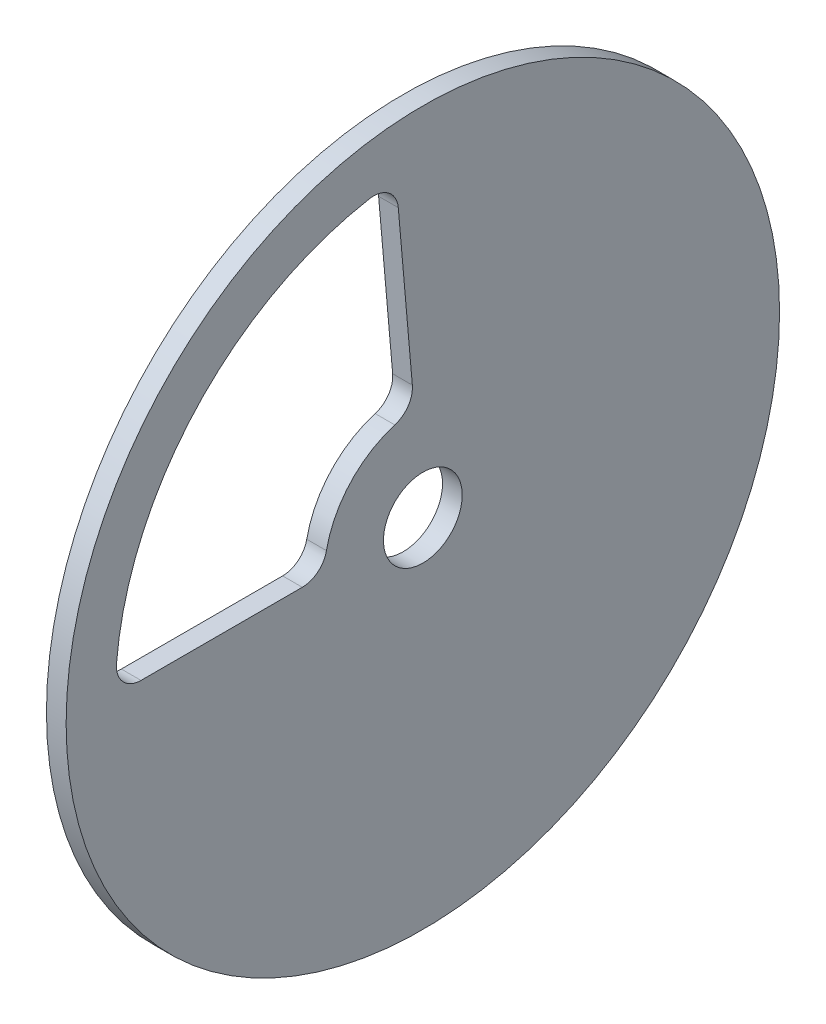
from build123d import *

# Parameters (mm, degrees)
SKETCH1_R           = 14.5
SKETCH1_R_2         = 1.6
BOSS_EXTRUDE1_DEPTH = 0.8


with BuildPart() as part:
    # Sketch1 → Boss-Extrude1 (new body)
    with BuildSketch(Plane(origin=(0, 0, 0), x_dir=(0, 0, -1), z_dir=(1, 0, 0))):
        Circle(SKETCH1_R)
        Circle(SKETCH1_R_2, mode=Mode.SUBTRACT)
        with BuildLine():
            Line((-0.426974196, 4.88033739), (-0.998494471, 11.412844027))
            ThreePointArc((-0.998494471, 11.412844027), (-1.385848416, 12.118980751), (-2.168140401, 12.310530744))
            ThreePointArc((-2.168140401, 12.310530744), (-9.21596671, 8.444877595), (-12.452651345, 1.086956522))
            ThreePointArc((-12.452651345, 1.086956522), (-12.193649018, 0.324336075), (-11.456439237, 0))
            Line((-11.456439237, 0), (-4.898979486, 0))
            ThreePointArc((-4.898979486, 0), (-4.266523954, 0.225403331), (-3.919183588, 0.8))
            ThreePointArc((-3.919183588, 0.8), (-2.949109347, 2.70236083), (-1.138535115, 3.834545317))
            ThreePointArc((-1.138535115, 3.834545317), (-0.596397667, 4.230643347), (-0.426974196, 4.88033739))
        make_face(mode=Mode.SUBTRACT)
    extrude(amount=BOSS_EXTRUDE1_DEPTH)


solid = part.part
